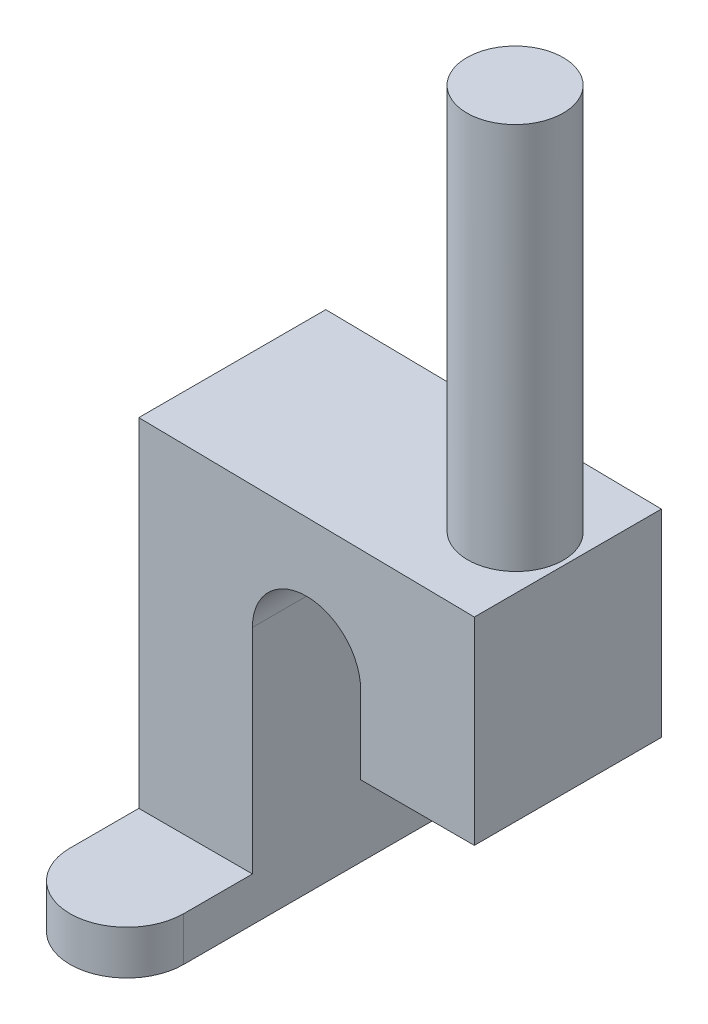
from build123d import *

# Parameters (mm, degrees)
BOSS_EXTRUDE1_DEPTH = 4.318
CUT_EXTRUDE1_REACH  = 38.412
SKETCH2_W           = 8.541760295
SKETCH2_H           = 11.079108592
SKETCH2_R           = 2.2225
SKETCH3_W           = 5.247
SKETCH3_H           = 2.032
BOSS_EXTRUDE2_DEPTH = 6.35
CUT_EXTRUDE2_DEPTH  = 27.880358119


with BuildPart() as part:
    # Sketch1 → Boss-Extrude1 (new, symmetric)
    with BuildSketch(Plane.XY):
        with BuildLine():
            Line((7.747, -3.592967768), (2.5, -3.592967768))
            Line((2.5, -3.592967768), (2.5, 0))
            ThreePointArc((2.5, 0), (0, 2.5), (-2.5, 0))
            Line((-2.5, 0), (-2.5, -11.890523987))
            Line((-2.5, -11.890523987), (-7.747, -11.890523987))
            Line((-7.747, -11.890523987), (-7.747, 5.76724639))
            Line((-7.747, 5.76724639), (2.873732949, 5.611740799))
            Line((2.873732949, 5.611740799), (2.873732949, 23.425016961))
            Line((2.873732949, 23.425016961), (7.747, 23.425016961))
            Line((7.747, 23.425016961), (7.747, -3.592967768))
        make_face()
    extrude(amount=BOSS_EXTRUDE1_DEPTH, both=True)

    # Cut-Extrude1: up to this plane
    cut_extrude1_end = Plane(origin=(2.873732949, 5.611740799, 4.318), z_dir=(-0.014640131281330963, -0.9998928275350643, 0))
    # Sketch2 → Cut-Extrude1 (cut, up to the surface)
    with BuildSketch(Plane(origin=(0, 23.425016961, 0), x_dir=(1, 0, 0), z_dir=(0, 1, 0)), mode=Mode.PRIVATE) as cut_extrude1_sk1:
        with Locations((5.587976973, 0.096845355)):
            Rectangle(SKETCH2_W, SKETCH2_H)
        with Locations(Location((5.310366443, 0, 0), (0, 0, 270))):
            Circle(SKETCH2_R, mode=Mode.SUBTRACT)
    cut_extrude1_tool1 = split(extrude(cut_extrude1_sk1.sketch, amount=-CUT_EXTRUDE1_REACH, mode=Mode.PRIVATE), bisect_by=cut_extrude1_end, keep=Keep.BOTH, mode=Mode.PRIVATE)
    add(cut_extrude1_tool1.solids().sort_by_distance((5.587977, 23.425017, -5.496504))[0], mode=Mode.SUBTRACT)

    # Sketch3 → Boss-Extrude2 (add)
    with BuildSketch(Plane.XY.offset(4.318)):
        with Locations((-5.1235, -10.874523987)):
            Rectangle(SKETCH3_W, SKETCH3_H)
    extrude(amount=BOSS_EXTRUDE2_DEPTH)

    # Sketch4 → Cut-Extrude2 (cut, through all)
    with BuildSketch(Plane(origin=(0, 0, 0), x_dir=(1, 0, 0), z_dir=(0, 1, 0))):
        with BuildLine():
            Line((-7.747, -7.493), (-9.552186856, -7.493))
            Line((-9.552186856, -7.493), (-9.552186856, -11.539215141))
            Line((-9.552186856, -11.539215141), (-1.066763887, -11.539215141))
            Line((-1.066763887, -11.539215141), (-1.066763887, -7.493))
            Line((-1.066763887, -7.493), (-2.5, -7.493))
            ThreePointArc((-2.5, -7.493), (-5.1235, -10.1165), (-7.747, -7.493))
        make_face()
    extrude(amount=-CUT_EXTRUDE2_DEPTH, mode=Mode.SUBTRACT)


solid = part.part
